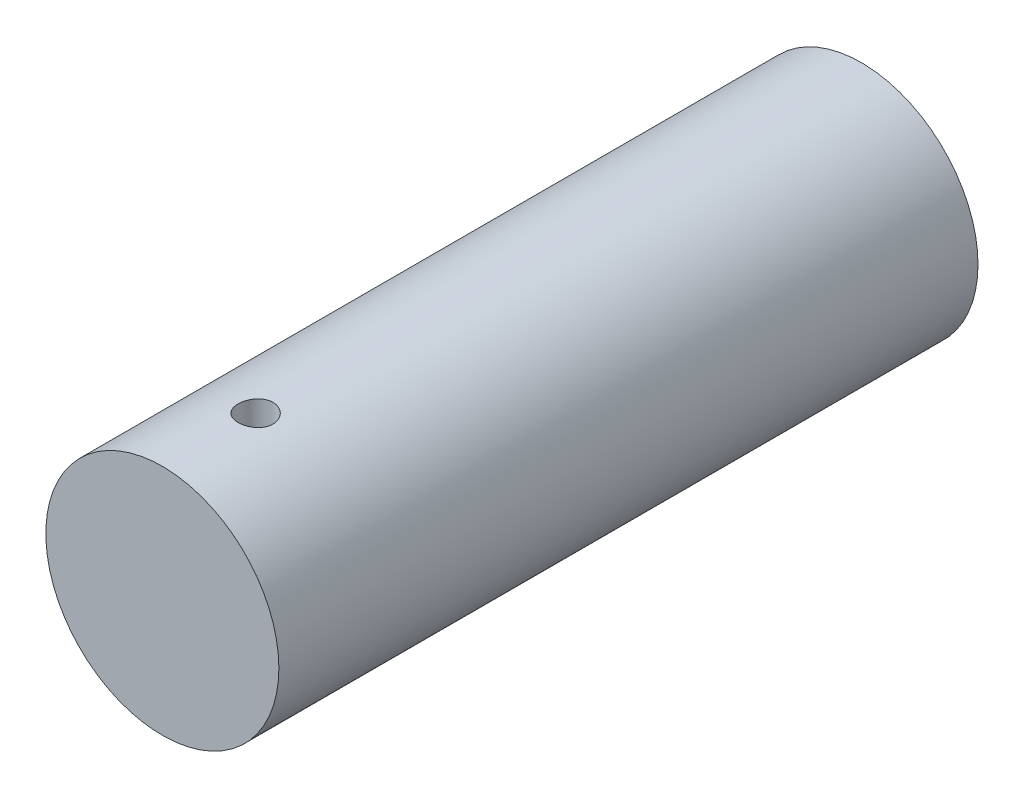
ISO-10303-21;
HEADER;
FILE_DESCRIPTION(('STEP AP214'),'2;1');
FILE_NAME('part.step','',(''),(''),'','','');
FILE_SCHEMA(('AUTOMOTIVE_DESIGN { 1 0 10303 214 1 1 1 1 }'));
ENDSEC;
DATA;
#1=APPLICATION_CONTEXT('core data for automotive mechanical design processes');
#2=APPLICATION_PROTOCOL_DEFINITION('international standard','automotive_design',2000,#1);
#3=PRODUCT_CONTEXT('',#1,'mechanical');
#4=PRODUCT('Part','Part','',(#3));
#5=PRODUCT_RELATED_PRODUCT_CATEGORY('part','',(#4));
#6=PRODUCT_DEFINITION_FORMATION('','',#4);
#7=PRODUCT_DEFINITION_CONTEXT('part definition',#1,'design');
#8=PRODUCT_DEFINITION('design','',#6,#7);
#9=PRODUCT_DEFINITION_SHAPE('','',#8);
#10=(LENGTH_UNIT() NAMED_UNIT(*) SI_UNIT(.MILLI.,.METRE.));
#11=(NAMED_UNIT(*) PLANE_ANGLE_UNIT() SI_UNIT($,.RADIAN.));
#12=(NAMED_UNIT(*) SI_UNIT($,.STERADIAN.) SOLID_ANGLE_UNIT());
#13=UNCERTAINTY_MEASURE_WITH_UNIT(LENGTH_MEASURE(1.E-05),#10,'distance_accuracy_value','');
#14=(GEOMETRIC_REPRESENTATION_CONTEXT(3) GLOBAL_UNCERTAINTY_ASSIGNED_CONTEXT((#13)) GLOBAL_UNIT_ASSIGNED_CONTEXT((#10,
#11,#12)) REPRESENTATION_CONTEXT('',''));
#15=CARTESIAN_POINT('',(0.,0.,0.));
#16=DIRECTION('',(0.,0.,1.));
#17=DIRECTION('',(1.,0.,0.));
#18=AXIS2_PLACEMENT_3D('',#15,#16,#17);
#19=CARTESIAN_POINT('',(0.,16.,78.));
#20=DIRECTION('',(0.,-1.,0.));
#21=DIRECTION('',(0.,0.,-1.));
#22=AXIS2_PLACEMENT_3D('',#19,#20,#21);
#23=CYLINDRICAL_SURFACE('',#22,2.25);
#24=DIRECTION('',(0.,-1.,0.));
#25=VECTOR('',#24,1.);
#26=CARTESIAN_POINT('',(0.,16.,75.75));
#27=LINE('',#26,#25);
#28=CARTESIAN_POINT('',(0.,15.,75.75));
#29=VERTEX_POINT('',#28);
#30=CARTESIAN_POINT('',(0.,-15.,75.75));
#31=VERTEX_POINT('',#30);
#32=EDGE_CURVE('E10',#29,#31,#27,.T.);
#33=ORIENTED_EDGE('',*,*,#32,.F.);
#34=CARTESIAN_POINT('',(0.,15.,75.75));
#35=CARTESIAN_POINT('',(0.26232197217,15.,75.75));
#36=CARTESIAN_POINT('',(0.518287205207,14.994757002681,75.784952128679));
#37=CARTESIAN_POINT('',(0.762708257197,14.984716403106,75.851894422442));
#38=CARTESIAN_POINT('',(0.99113956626,14.970876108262,75.947126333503));
#39=CARTESIAN_POINT('',(1.19994656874,14.954607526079,76.06622056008));
#40=CARTESIAN_POINT('',(1.386449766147,14.937372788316,76.204044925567));
#41=CARTESIAN_POINT('',(1.549113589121,14.920446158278,76.354796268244));
#42=CARTESIAN_POINT('',(1.832038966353,14.888408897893,76.675712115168));
#43=CARTESIAN_POINT('',(1.953742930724,14.873010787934,76.850321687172));
#44=CARTESIAN_POINT('',(2.053691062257,14.859338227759,77.03287799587));
#45=CARTESIAN_POINT('',(2.13269663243,14.847939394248,77.221118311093));
#46=CARTESIAN_POINT('',(2.191454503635,14.839172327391,77.413286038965));
#47=CARTESIAN_POINT('',(2.230469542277,14.833253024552,77.607958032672));
#48=CARTESIAN_POINT('',(2.25,14.830289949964,77.803909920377));
#49=CARTESIAN_POINT('',(2.25,14.830289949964,78.234982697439));
#50=CARTESIAN_POINT('',(2.22195304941,14.83454488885,78.469615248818));
#51=CARTESIAN_POINT('',(2.166007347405,14.843033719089,78.702064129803));
#52=CARTESIAN_POINT('',(2.081570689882,14.855538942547,78.930314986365));
#53=CARTESIAN_POINT('',(1.967566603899,14.871627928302,79.151760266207));
#54=CARTESIAN_POINT('',(1.822593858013,14.890533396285,79.362934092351));
#55=CARTESIAN_POINT('',(1.645165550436,14.911014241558,79.559132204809));
#56=CARTESIAN_POINT('',(1.254168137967,14.948570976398,79.882593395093));
#57=CARTESIAN_POINT('',(1.042785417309,14.966371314,80.02147509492));
#58=CARTESIAN_POINT('',(0.803197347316,14.982862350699,80.13812613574));
#59=CARTESIAN_POINT('',(0.541239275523,14.995859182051,80.2234762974));
#60=CARTESIAN_POINT('',(0.264900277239,15.003361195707,80.271524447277));
#61=CARTESIAN_POINT('',(-0.01675063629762,15.004454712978,80.279382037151));
#62=CARTESIAN_POINT('',(-0.294407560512,14.999457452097,80.247389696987));
#63=CARTESIAN_POINT('',(-0.730722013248,14.983170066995,80.135363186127));
#64=CARTESIAN_POINT('',(-0.897940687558,14.974691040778,80.076050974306));
#65=CARTESIAN_POINT('',(-1.059597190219,14.964359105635,80.001791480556));
#66=CARTESIAN_POINT('',(-1.214143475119,14.952520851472,79.913200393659));
#67=CARTESIAN_POINT('',(-1.360114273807,14.939611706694,79.811081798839));
#68=CARTESIAN_POINT('',(-1.496149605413,14.926126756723,79.696417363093));
#69=CARTESIAN_POINT('',(-1.621020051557,14.91258369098,79.570355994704));
#70=CARTESIAN_POINT('',(-1.857548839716,14.885061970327,79.284441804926));
#71=CARTESIAN_POINT('',(-1.966683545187,14.8711704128,79.122416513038));
#72=CARTESIAN_POINT('',(-2.05960820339,14.858463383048,78.949859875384));
#73=CARTESIAN_POINT('',(-2.135150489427,14.847572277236,78.768686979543));
#74=CARTESIAN_POINT('',(-2.192418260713,14.839026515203,78.58094789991));
#75=CARTESIAN_POINT('',(-2.230805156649,14.833201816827,78.388784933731));
#76=CARTESIAN_POINT('',(-2.25,14.830289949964,78.194395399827));
#77=CARTESIAN_POINT('',(-2.25,14.830289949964,77.803897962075));
#78=CARTESIAN_POINT('',(-2.23046719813,14.83325337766,77.607946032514));
#79=CARTESIAN_POINT('',(-2.191451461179,14.839172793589,77.413279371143));
#80=CARTESIAN_POINT('',(-2.132695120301,14.847939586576,77.221117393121));
#81=CARTESIAN_POINT('',(-2.053691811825,14.859338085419,77.032880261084));
#82=CARTESIAN_POINT('',(-1.953744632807,14.873010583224,76.850323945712));
#83=CARTESIAN_POINT('',(-1.832039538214,14.888408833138,76.675712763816));
#84=CARTESIAN_POINT('',(-1.549171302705,14.920439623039,76.354861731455));
#85=CARTESIAN_POINT('',(-1.386512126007,14.937366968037,76.204087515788));
#86=CARTESIAN_POINT('',(-1.199965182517,14.954607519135,76.066212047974));
#87=CARTESIAN_POINT('',(-0.99108572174,14.970882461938,75.94707817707));
#88=CARTESIAN_POINT('',(-0.762583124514,14.984724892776,75.851837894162));
#89=CARTESIAN_POINT('',(-0.518126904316,14.994762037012,75.784918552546));
#90=CARTESIAN_POINT('',(-0.262195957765,15.,75.75));
#91=CARTESIAN_POINT('',(0.,15.,75.75));
#92=(BOUNDED_CURVE() B_SPLINE_CURVE(8,(#34,#35,#36,#37,#38,#39,#40,#41,#42,#43,#44,#45,#46,#47,
#48,#49,#50,#51,#52,#53,#54,#55,#56,#57,#58,#59,#60,#61,#62,#63,#64,#65,#66,#67,#68,#69,#70,#71,
#72,#73,#74,#75,#76,#77,#78,#79,#80,#81,#82,#83,#84,#85,#86,#87,#88,#89,#90,#91),.UNSPECIFIED.,
.T.,.F.) B_SPLINE_CURVE_WITH_KNOTS((9,7,7,7,7,7,7,7,9),(0.,0.137174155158,0.279941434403,
0.451025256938,0.59702919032,0.69128512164,0.79496315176,0.899551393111,1.),
.UNSPECIFIED.) CURVE() GEOMETRIC_REPRESENTATION_ITEM() RATIONAL_B_SPLINE_CURVE((1.,1.,1.,1.,1.,
1.,1.,1.,1.,1.,1.,1.,1.,1.,1.,1.,1.,1.,1.,1.,1.,1.,1.,1.,1.,1.,1.,1.,1.,1.,1.,1.,1.,1.,1.,1.,1.,
1.,1.,1.,1.,1.,1.,1.,1.,1.,1.,1.,1.,1.,1.,1.,1.,1.,1.,1.,1.,1.)) REPRESENTATION_ITEM(''));
#93=EDGE_CURVE('E57',#29,#29,#92,.T.);
#94=ORIENTED_EDGE('',*,*,#93,.F.);
#95=ORIENTED_EDGE('',*,*,#32,.T.);
#96=CARTESIAN_POINT('',(0.,-15.,75.75));
#97=CARTESIAN_POINT('',(0.26232197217,-15.,75.75));
#98=CARTESIAN_POINT('',(0.518287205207,-14.99475700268,75.784952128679));
#99=CARTESIAN_POINT('',(0.762708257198,-14.9847164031,75.851894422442));
#100=CARTESIAN_POINT('',(0.991139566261,-14.97087610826,75.947126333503));
#101=CARTESIAN_POINT('',(1.19994656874,-14.95460752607,76.06622056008));
#102=CARTESIAN_POINT('',(1.386449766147,-14.93737278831,76.204044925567));
#103=CARTESIAN_POINT('',(1.549113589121,-14.92044615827,76.354796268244));
#104=CARTESIAN_POINT('',(1.832038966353,-14.88840889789,76.675712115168));
#105=CARTESIAN_POINT('',(1.953742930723,-14.87301078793,76.850321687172));
#106=CARTESIAN_POINT('',(2.053691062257,-14.85933822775,77.03287799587));
#107=CARTESIAN_POINT('',(2.13269663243,-14.84793939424,77.221118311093));
#108=CARTESIAN_POINT('',(2.191454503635,-14.83917232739,77.413286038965));
#109=CARTESIAN_POINT('',(2.230469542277,-14.83325302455,77.607958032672));
#110=CARTESIAN_POINT('',(2.25,-14.83028994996,77.803909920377));
#111=CARTESIAN_POINT('',(2.25,-14.83028994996,78.234982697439));
#112=CARTESIAN_POINT('',(2.22195304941,-14.83454488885,78.469615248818));
#113=CARTESIAN_POINT('',(2.166007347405,-14.84303371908,78.702064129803));
#114=CARTESIAN_POINT('',(2.081570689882,-14.85553894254,78.930314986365));
#115=CARTESIAN_POINT('',(1.967566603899,-14.8716279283,79.151760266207));
#116=CARTESIAN_POINT('',(1.822593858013,-14.89053339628,79.362934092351));
#117=CARTESIAN_POINT('',(1.645165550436,-14.91101424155,79.559132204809));
#118=CARTESIAN_POINT('',(1.254168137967,-14.94857097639,79.882593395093));
#119=CARTESIAN_POINT('',(1.042785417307,-14.966371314,80.02147509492));
#120=CARTESIAN_POINT('',(0.80319734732,-14.98286235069,80.13812613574));
#121=CARTESIAN_POINT('',(0.541239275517,-14.99585918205,80.223476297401));
#122=CARTESIAN_POINT('',(0.264900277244,-15.0033611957,80.271524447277));
#123=CARTESIAN_POINT('',(-0.01675063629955,-15.00445471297,80.279382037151));
#124=CARTESIAN_POINT('',(-0.294407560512,-14.99945745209,80.247389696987));
#125=CARTESIAN_POINT('',(-0.730722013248,-14.98317006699,80.135363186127));
#126=CARTESIAN_POINT('',(-0.897940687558,-14.97469104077,80.076050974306));
#127=CARTESIAN_POINT('',(-1.059597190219,-14.96435910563,80.001791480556));
#128=CARTESIAN_POINT('',(-1.214143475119,-14.95252085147,79.913200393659));
#129=CARTESIAN_POINT('',(-1.360114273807,-14.93961170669,79.811081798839));
#130=CARTESIAN_POINT('',(-1.496149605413,-14.92612675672,79.696417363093));
#131=CARTESIAN_POINT('',(-1.621020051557,-14.91258369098,79.570355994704));
#132=CARTESIAN_POINT('',(-1.857548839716,-14.88506197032,79.284441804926));
#133=CARTESIAN_POINT('',(-1.966683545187,-14.8711704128,79.122416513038));
#134=CARTESIAN_POINT('',(-2.05960820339,-14.85846338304,78.949859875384));
#135=CARTESIAN_POINT('',(-2.135150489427,-14.84757227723,78.768686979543));
#136=CARTESIAN_POINT('',(-2.192418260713,-14.8390265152,78.58094789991));
#137=CARTESIAN_POINT('',(-2.230805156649,-14.83320181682,78.388784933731));
#138=CARTESIAN_POINT('',(-2.25,-14.83028994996,78.194395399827));
#139=CARTESIAN_POINT('',(-2.25,-14.83028994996,77.803897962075));
#140=CARTESIAN_POINT('',(-2.23046719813,-14.83325337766,77.607946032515));
#141=CARTESIAN_POINT('',(-2.191451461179,-14.83917279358,77.413279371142));
#142=CARTESIAN_POINT('',(-2.132695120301,-14.84793958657,77.221117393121));
#143=CARTESIAN_POINT('',(-2.053691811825,-14.85933808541,77.032880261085));
#144=CARTESIAN_POINT('',(-1.953744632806,-14.87301058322,76.850323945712));
#145=CARTESIAN_POINT('',(-1.832039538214,-14.88840883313,76.675712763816));
#146=CARTESIAN_POINT('',(-1.549171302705,-14.92043962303,76.354861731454));
#147=CARTESIAN_POINT('',(-1.386512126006,-14.93736696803,76.204087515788));
#148=CARTESIAN_POINT('',(-1.199965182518,-14.95460751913,76.066212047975));
#149=CARTESIAN_POINT('',(-0.991085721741,-14.97088246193,75.94707817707));
#150=CARTESIAN_POINT('',(-0.762583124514,-14.98472489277,75.851837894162));
#151=CARTESIAN_POINT('',(-0.518126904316,-14.99476203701,75.784918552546));
#152=CARTESIAN_POINT('',(-0.262195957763,-15.,75.75));
#153=CARTESIAN_POINT('',(0.,-15.,75.75));
#154=(BOUNDED_CURVE() B_SPLINE_CURVE(8,(#96,#97,#98,#99,#100,#101,#102,#103,#104,#105,#106,#107,
#108,#109,#110,#111,#112,#113,#114,#115,#116,#117,#118,#119,#120,#121,#122,#123,#124,#125,#126,
#127,#128,#129,#130,#131,#132,#133,#134,#135,#136,#137,#138,#139,#140,#141,#142,#143,#144,#145,
#146,#147,#148,#149,#150,#151,#152,#153),.UNSPECIFIED.,.T.,.F.) B_SPLINE_CURVE_WITH_KNOTS((9,7,
7,7,7,7,7,7,9),(0.,0.137174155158,0.279941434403,0.451025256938,0.59702919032,0.69128512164,
0.79496315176,0.89955139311,1.),
.UNSPECIFIED.) CURVE() GEOMETRIC_REPRESENTATION_ITEM() RATIONAL_B_SPLINE_CURVE((1.,1.,1.,1.,1.,
1.,1.,1.,1.,1.,1.,1.,1.,1.,1.,1.,1.,1.,1.,1.,1.,1.,1.,1.,1.,1.,1.,1.,1.,1.,1.,1.,1.,1.,1.,1.,1.,
1.,1.,1.,1.,1.,1.,1.,1.,1.,1.,1.,1.,1.,1.,1.,1.,1.,1.,1.,1.,1.)) REPRESENTATION_ITEM(''));
#155=EDGE_CURVE('E24',#31,#31,#154,.T.);
#156=ORIENTED_EDGE('',*,*,#155,.T.);
#157=EDGE_LOOP('',(#33,#94,#95,#156));
#158=FACE_BOUND('',#157,.T.);
#159=ADVANCED_FACE('F16',(#158),#23,.F.);
#160=CARTESIAN_POINT('',(0.,0.,90.));
#161=DIRECTION('',(0.,0.,1.));
#162=DIRECTION('',(1.,0.,0.));
#163=AXIS2_PLACEMENT_3D('',#160,#161,#162);
#164=PLANE('',#163);
#165=CARTESIAN_POINT('',(0.,0.,90.));
#166=DIRECTION('',(0.,0.,1.));
#167=DIRECTION('',(1.,0.,0.));
#168=AXIS2_PLACEMENT_3D('',#165,#166,#167);
#169=CIRCLE('',#168,15.);
#170=CARTESIAN_POINT('',(15.,0.,90.));
#171=VERTEX_POINT('',#170);
#172=EDGE_CURVE('E58',#171,#171,#169,.T.);
#173=ORIENTED_EDGE('',*,*,#172,.T.);
#174=EDGE_LOOP('',(#173));
#175=FACE_BOUND('',#174,.T.);
#176=ADVANCED_FACE('F88',(#175),#164,.T.);
#177=CARTESIAN_POINT('',(0.,0.,0.));
#178=DIRECTION('',(0.,0.,1.));
#179=DIRECTION('',(1.,0.,0.));
#180=AXIS2_PLACEMENT_3D('',#177,#178,#179);
#181=PLANE('',#180);
#182=CARTESIAN_POINT('',(0.,0.,0.));
#183=DIRECTION('',(0.,0.,1.));
#184=DIRECTION('',(1.,0.,0.));
#185=AXIS2_PLACEMENT_3D('',#182,#183,#184);
#186=CIRCLE('',#185,15.);
#187=CARTESIAN_POINT('',(15.,0.,0.));
#188=VERTEX_POINT('',#187);
#189=EDGE_CURVE('E51',#188,#188,#186,.T.);
#190=ORIENTED_EDGE('',*,*,#189,.F.);
#191=EDGE_LOOP('',(#190));
#192=FACE_BOUND('',#191,.T.);
#193=ADVANCED_FACE('F82',(#192),#181,.F.);
#194=CARTESIAN_POINT('',(0.,0.,0.));
#195=DIRECTION('',(0.,0.,-1.));
#196=DIRECTION('',(1.,0.,0.));
#197=AXIS2_PLACEMENT_3D('',#194,#195,#196);
#198=CYLINDRICAL_SURFACE('',#197,15.);
#199=ORIENTED_EDGE('',*,*,#155,.F.);
#200=EDGE_LOOP('',(#199));
#201=FACE_BOUND('',#200,.T.);
#202=ORIENTED_EDGE('',*,*,#93,.T.);
#203=EDGE_LOOP('',(#202));
#204=FACE_BOUND('',#203,.T.);
#205=DIRECTION('',(0.,0.,1.));
#206=VECTOR('',#205,1.);
#207=CARTESIAN_POINT('',(15.,0.,0.));
#208=LINE('',#207,#206);
#209=EDGE_CURVE('E54',#188,#171,#208,.T.);
#210=ORIENTED_EDGE('',*,*,#209,.T.);
#211=ORIENTED_EDGE('',*,*,#172,.F.);
#212=ORIENTED_EDGE('',*,*,#209,.F.);
#213=ORIENTED_EDGE('',*,*,#189,.T.);
#214=EDGE_LOOP('',(#210,#211,#212,#213));
#215=FACE_BOUND('',#214,.T.);
#216=ADVANCED_FACE('F52',(#201,#204,#215),#198,.T.);
#217=CLOSED_SHELL('',(#159,#176,#193,#216));
#218=MANIFOLD_SOLID_BREP('B1',#217);
#219=ADVANCED_BREP_SHAPE_REPRESENTATION('',(#18,#218),#14);
#220=SHAPE_DEFINITION_REPRESENTATION(#9,#219);
ENDSEC;
END-ISO-10303-21;
